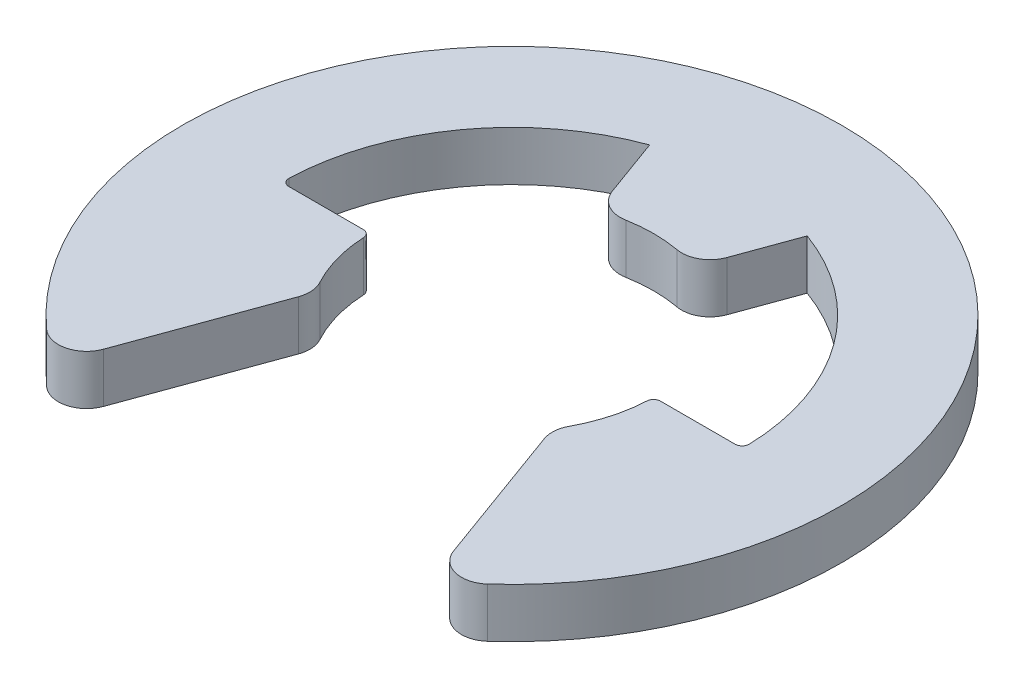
ISO-10303-21;
HEADER;
FILE_DESCRIPTION(('STEP AP214'),'2;1');
FILE_NAME('part.step','',(''),(''),'','','');
FILE_SCHEMA(('AUTOMOTIVE_DESIGN { 1 0 10303 214 1 1 1 1 }'));
ENDSEC;
DATA;
#1=APPLICATION_CONTEXT('core data for automotive mechanical design processes');
#2=APPLICATION_PROTOCOL_DEFINITION('international standard','automotive_design',2000,#1);
#3=PRODUCT_CONTEXT('',#1,'mechanical');
#4=PRODUCT('Part','Part','',(#3));
#5=PRODUCT_RELATED_PRODUCT_CATEGORY('part','',(#4));
#6=PRODUCT_DEFINITION_FORMATION('','',#4);
#7=PRODUCT_DEFINITION_CONTEXT('part definition',#1,'design');
#8=PRODUCT_DEFINITION('design','',#6,#7);
#9=PRODUCT_DEFINITION_SHAPE('','',#8);
#10=(LENGTH_UNIT() NAMED_UNIT(*) SI_UNIT(.MILLI.,.METRE.));
#11=(NAMED_UNIT(*) PLANE_ANGLE_UNIT() SI_UNIT($,.RADIAN.));
#12=(NAMED_UNIT(*) SI_UNIT($,.STERADIAN.) SOLID_ANGLE_UNIT());
#13=UNCERTAINTY_MEASURE_WITH_UNIT(LENGTH_MEASURE(1.E-05),#10,'distance_accuracy_value','');
#14=(GEOMETRIC_REPRESENTATION_CONTEXT(3) GLOBAL_UNCERTAINTY_ASSIGNED_CONTEXT((#13)) GLOBAL_UNIT_ASSIGNED_CONTEXT((#10,
#11,#12)) REPRESENTATION_CONTEXT('',''));
#15=CARTESIAN_POINT('',(0.,0.,0.));
#16=DIRECTION('',(0.,0.,1.));
#17=DIRECTION('',(1.,0.,0.));
#18=AXIS2_PLACEMENT_3D('',#15,#16,#17);
#19=CARTESIAN_POINT('',(0.,0.35,0.));
#20=DIRECTION('',(0.,-1.,0.));
#21=DIRECTION('',(0.,0.,-1.));
#22=AXIS2_PLACEMENT_3D('',#19,#20,#21);
#23=CYLINDRICAL_SURFACE('',#22,3.25);
#24=CARTESIAN_POINT('',(0.,0.35,0.));
#25=DIRECTION('',(0.,-1.,0.));
#26=DIRECTION('',(0.,0.,1.));
#27=AXIS2_PLACEMENT_3D('',#24,#25,#26);
#28=CIRCLE('',#27,3.25);
#29=CARTESIAN_POINT('',(-3.24836189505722,0.35,-0.103174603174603));
#30=VERTEX_POINT('',#29);
#31=CARTESIAN_POINT('',(-1.11156546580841,0.35,-3.05400101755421));
#32=VERTEX_POINT('',#31);
#33=EDGE_CURVE('E187',#30,#32,#28,.T.);
#34=ORIENTED_EDGE('',*,*,#33,.F.);
#35=DIRECTION('',(0.,-1.,0.));
#36=VECTOR('',#35,1.);
#37=CARTESIAN_POINT('',(-3.24836189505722,0.35,-0.103174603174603));
#38=LINE('',#37,#36);
#39=CARTESIAN_POINT('',(-3.24836189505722,-0.35,-0.103174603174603));
#40=VERTEX_POINT('',#39);
#41=EDGE_CURVE('E327',#30,#40,#38,.T.);
#42=ORIENTED_EDGE('',*,*,#41,.T.);
#43=CARTESIAN_POINT('',(0.,-0.35,0.));
#44=DIRECTION('',(0.,-1.,0.));
#45=DIRECTION('',(0.,0.,1.));
#46=AXIS2_PLACEMENT_3D('',#43,#44,#45);
#47=CIRCLE('',#46,3.25);
#48=CARTESIAN_POINT('',(-1.11156546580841,-0.35,-3.05400101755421));
#49=VERTEX_POINT('',#48);
#50=EDGE_CURVE('E211',#40,#49,#47,.T.);
#51=ORIENTED_EDGE('',*,*,#50,.T.);
#52=DIRECTION('',(0.,-1.,0.));
#53=VECTOR('',#52,1.);
#54=CARTESIAN_POINT('',(-1.11156546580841,0.35,-3.05400101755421));
#55=LINE('',#54,#53);
#56=EDGE_CURVE('E204',#32,#49,#55,.T.);
#57=ORIENTED_EDGE('',*,*,#56,.F.);
#58=EDGE_LOOP('',(#34,#42,#51,#57));
#59=FACE_BOUND('',#58,.T.);
#60=ADVANCED_FACE('F39',(#59),#23,.F.);
#61=CARTESIAN_POINT('',(-1.11156546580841,0.35,-3.05400101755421));
#62=DIRECTION('',(0.939692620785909,0.,-0.342020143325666));
#63=DIRECTION('',(-0.342020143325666,0.,-0.93969262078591));
#64=AXIS2_PLACEMENT_3D('',#61,#62,#63);
#65=PLANE('',#64);
#66=DIRECTION('',(0.342020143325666,0.,0.939692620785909));
#67=VECTOR('',#66,1.);
#68=CARTESIAN_POINT('',(-1.11156546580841,-0.35,-3.05400101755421));
#69=LINE('',#68,#67);
#70=CARTESIAN_POINT('',(-0.809367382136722,-0.35,-2.22371860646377));
#71=VERTEX_POINT('',#70);
#72=EDGE_CURVE('E446',#49,#71,#69,.T.);
#73=ORIENTED_EDGE('',*,*,#72,.T.);
#74=DIRECTION('',(0.,-1.,0.));
#75=VECTOR('',#74,1.);
#76=CARTESIAN_POINT('',(-0.809367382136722,0.35,-2.22371860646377));
#77=LINE('',#76,#75);
#78=CARTESIAN_POINT('',(-0.809367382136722,0.35,-2.22371860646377));
#79=VERTEX_POINT('',#78);
#80=EDGE_CURVE('E206',#71,#79,#77,.F.);
#81=ORIENTED_EDGE('',*,*,#80,.T.);
#82=DIRECTION('',(0.342020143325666,0.,0.939692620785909));
#83=VECTOR('',#82,1.);
#84=CARTESIAN_POINT('',(-1.11156546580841,0.35,-3.05400101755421));
#85=LINE('',#84,#83);
#86=EDGE_CURVE('E191',#32,#79,#85,.T.);
#87=ORIENTED_EDGE('',*,*,#86,.F.);
#88=ORIENTED_EDGE('',*,*,#56,.T.);
#89=EDGE_LOOP('',(#73,#81,#87,#88));
#90=FACE_BOUND('',#89,.T.);
#91=ADVANCED_FACE('F203',(#90),#65,.F.);
#92=CARTESIAN_POINT('',(0.,0.35,0.));
#93=DIRECTION('',(0.,-1.,0.));
#94=DIRECTION('',(0.,0.,-1.));
#95=AXIS2_PLACEMENT_3D('',#92,#93,#94);
#96=CYLINDRICAL_SURFACE('',#95,2.);
#97=CARTESIAN_POINT('',(0.,-0.35,0.));
#98=DIRECTION('',(0.,-1.,0.));
#99=DIRECTION('',(0.,0.,1.));
#100=AXIS2_PLACEMENT_3D('',#97,#98,#99);
#101=CIRCLE('',#100,2.);
#102=CARTESIAN_POINT('',(-0.361241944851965,-0.35,-1.96710555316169));
#103=VERTEX_POINT('',#102);
#104=CARTESIAN_POINT('',(0.361241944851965,-0.35,-1.96710555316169));
#105=VERTEX_POINT('',#104);
#106=EDGE_CURVE('E449',#103,#105,#101,.T.);
#107=ORIENTED_EDGE('',*,*,#106,.T.);
#108=DIRECTION('',(0.,-1.,0.));
#109=VECTOR('',#108,1.);
#110=CARTESIAN_POINT('',(0.361241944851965,0.35,-1.96710555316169));
#111=LINE('',#110,#109);
#112=CARTESIAN_POINT('',(0.361241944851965,0.35,-1.96710555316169));
#113=VERTEX_POINT('',#112);
#114=EDGE_CURVE('E289',#105,#113,#111,.F.);
#115=ORIENTED_EDGE('',*,*,#114,.T.);
#116=CARTESIAN_POINT('',(0.,0.35,0.));
#117=DIRECTION('',(0.,-1.,0.));
#118=DIRECTION('',(0.,0.,1.));
#119=AXIS2_PLACEMENT_3D('',#116,#117,#118);
#120=CIRCLE('',#119,2.);
#121=CARTESIAN_POINT('',(-0.361241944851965,0.35,-1.96710555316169));
#122=VERTEX_POINT('',#121);
#123=EDGE_CURVE('E208',#122,#113,#120,.T.);
#124=ORIENTED_EDGE('',*,*,#123,.F.);
#125=DIRECTION('',(0.,-1.,0.));
#126=VECTOR('',#125,1.);
#127=CARTESIAN_POINT('',(-0.361241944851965,0.35,-1.96710555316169));
#128=LINE('',#127,#126);
#129=EDGE_CURVE('E285',#122,#103,#128,.T.);
#130=ORIENTED_EDGE('',*,*,#129,.T.);
#131=EDGE_LOOP('',(#107,#115,#124,#130));
#132=FACE_BOUND('',#131,.T.);
#133=ADVANCED_FACE('F370',(#132),#96,.F.);
#134=CARTESIAN_POINT('',(0.684040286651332,0.35,-1.87938524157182));
#135=DIRECTION('',(-0.93969262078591,0.,-0.342020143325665));
#136=DIRECTION('',(-0.342020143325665,0.,0.93969262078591));
#137=AXIS2_PLACEMENT_3D('',#134,#135,#136);
#138=PLANE('',#137);
#139=DIRECTION('',(0.342020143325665,0.,-0.93969262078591));
#140=VECTOR('',#139,1.);
#141=CARTESIAN_POINT('',(0.684040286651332,0.35,-1.87938524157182));
#142=LINE('',#141,#140);
#143=CARTESIAN_POINT('',(0.809367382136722,0.35,-2.22371860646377));
#144=VERTEX_POINT('',#143);
#145=CARTESIAN_POINT('',(1.11156546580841,0.35,-3.05400101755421));
#146=VERTEX_POINT('',#145);
#147=EDGE_CURVE('E423',#144,#146,#142,.T.);
#148=ORIENTED_EDGE('',*,*,#147,.F.);
#149=DIRECTION('',(0.,-1.,0.));
#150=VECTOR('',#149,1.);
#151=CARTESIAN_POINT('',(0.809367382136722,0.35,-2.22371860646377));
#152=LINE('',#151,#150);
#153=CARTESIAN_POINT('',(0.809367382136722,-0.35,-2.22371860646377));
#154=VERTEX_POINT('',#153);
#155=EDGE_CURVE('E281',#144,#154,#152,.T.);
#156=ORIENTED_EDGE('',*,*,#155,.T.);
#157=DIRECTION('',(0.342020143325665,0.,-0.93969262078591));
#158=VECTOR('',#157,1.);
#159=CARTESIAN_POINT('',(0.684040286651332,-0.35,-1.87938524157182));
#160=LINE('',#159,#158);
#161=CARTESIAN_POINT('',(1.11156546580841,-0.35,-3.05400101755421));
#162=VERTEX_POINT('',#161);
#163=EDGE_CURVE('E453',#154,#162,#160,.T.);
#164=ORIENTED_EDGE('',*,*,#163,.T.);
#165=DIRECTION('',(0.,-1.,0.));
#166=VECTOR('',#165,1.);
#167=CARTESIAN_POINT('',(1.11156546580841,0.35,-3.05400101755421));
#168=LINE('',#167,#166);
#169=EDGE_CURVE('E215',#146,#162,#168,.T.);
#170=ORIENTED_EDGE('',*,*,#169,.F.);
#171=EDGE_LOOP('',(#148,#156,#164,#170));
#172=FACE_BOUND('',#171,.T.);
#173=ADVANCED_FACE('F527',(#172),#138,.F.);
#174=CARTESIAN_POINT('',(0.,0.35,0.));
#175=DIRECTION('',(0.,-1.,0.));
#176=DIRECTION('',(0.,0.,-1.));
#177=AXIS2_PLACEMENT_3D('',#174,#175,#176);
#178=CYLINDRICAL_SURFACE('',#177,3.25);
#179=CARTESIAN_POINT('',(0.,-0.35,0.));
#180=DIRECTION('',(0.,-1.,0.));
#181=DIRECTION('',(0.,0.,1.));
#182=AXIS2_PLACEMENT_3D('',#179,#180,#181);
#183=CIRCLE('',#182,3.25);
#184=CARTESIAN_POINT('',(3.24836189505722,-0.35,-0.103174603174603));
#185=VERTEX_POINT('',#184);
#186=EDGE_CURVE('E456',#162,#185,#183,.T.);
#187=ORIENTED_EDGE('',*,*,#186,.T.);
#188=DIRECTION('',(0.,-1.,0.));
#189=VECTOR('',#188,1.);
#190=CARTESIAN_POINT('',(3.24836189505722,0.35,-0.103174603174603));
#191=LINE('',#190,#189);
#192=CARTESIAN_POINT('',(3.24836189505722,0.35,-0.103174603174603));
#193=VERTEX_POINT('',#192);
#194=EDGE_CURVE('E308',#185,#193,#191,.F.);
#195=ORIENTED_EDGE('',*,*,#194,.T.);
#196=CARTESIAN_POINT('',(0.,0.35,0.));
#197=DIRECTION('',(0.,-1.,0.));
#198=DIRECTION('',(0.,0.,1.));
#199=AXIS2_PLACEMENT_3D('',#196,#197,#198);
#200=CIRCLE('',#199,3.25);
#201=EDGE_CURVE('E410',#146,#193,#200,.T.);
#202=ORIENTED_EDGE('',*,*,#201,.F.);
#203=ORIENTED_EDGE('',*,*,#169,.T.);
#204=EDGE_LOOP('',(#187,#195,#202,#203));
#205=FACE_BOUND('',#204,.T.);
#206=ADVANCED_FACE('F521',(#205),#178,.F.);
#207=CARTESIAN_POINT('',(2.,0.35,0.));
#208=DIRECTION('',(0.,0.,1.));
#209=DIRECTION('',(1.,0.,0.));
#210=AXIS2_PLACEMENT_3D('',#207,#208,#209);
#211=PLANE('',#210);
#212=DIRECTION('',(-1.,0.,0.));
#213=VECTOR('',#212,1.);
#214=CARTESIAN_POINT('',(2.,0.35,0.));
#215=LINE('',#214,#213);
#216=CARTESIAN_POINT('',(3.14841229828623,0.35,0.));
#217=VERTEX_POINT('',#216);
#218=CARTESIAN_POINT('',(2.0976176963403,0.35,0.));
#219=VERTEX_POINT('',#218);
#220=EDGE_CURVE('E407',#217,#219,#215,.T.);
#221=ORIENTED_EDGE('',*,*,#220,.F.);
#222=DIRECTION('',(0.,1.,0.));
#223=VECTOR('',#222,1.);
#224=CARTESIAN_POINT('',(3.14841229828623,-0.35,0.));
#225=LINE('',#224,#223);
#226=CARTESIAN_POINT('',(3.14841229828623,-0.35,0.));
#227=VERTEX_POINT('',#226);
#228=EDGE_CURVE('E304',#217,#227,#225,.F.);
#229=ORIENTED_EDGE('',*,*,#228,.T.);
#230=DIRECTION('',(-1.,0.,0.));
#231=VECTOR('',#230,1.);
#232=CARTESIAN_POINT('',(2.,-0.35,0.));
#233=LINE('',#232,#231);
#234=CARTESIAN_POINT('',(2.0976176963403,-0.35,0.));
#235=VERTEX_POINT('',#234);
#236=EDGE_CURVE('E460',#227,#235,#233,.T.);
#237=ORIENTED_EDGE('',*,*,#236,.T.);
#238=DIRECTION('',(0.,-1.,0.));
#239=VECTOR('',#238,1.);
#240=CARTESIAN_POINT('',(2.0976176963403,0.35,0.));
#241=LINE('',#240,#239);
#242=EDGE_CURVE('E301',#235,#219,#241,.F.);
#243=ORIENTED_EDGE('',*,*,#242,.T.);
#244=EDGE_LOOP('',(#221,#229,#237,#243));
#245=FACE_BOUND('',#244,.T.);
#246=ADVANCED_FACE('F412',(#245),#211,.F.);
#247=CARTESIAN_POINT('',(0.,0.35,0.));
#248=DIRECTION('',(0.,-1.,0.));
#249=DIRECTION('',(0.,0.,-1.));
#250=AXIS2_PLACEMENT_3D('',#247,#248,#249);
#251=CYLINDRICAL_SURFACE('',#250,2.);
#252=CARTESIAN_POINT('',(0.,0.35,0.));
#253=DIRECTION('',(0.,-1.,0.));
#254=DIRECTION('',(0.,0.,1.));
#255=AXIS2_PLACEMENT_3D('',#252,#253,#254);
#256=CIRCLE('',#255,2.);
#257=CARTESIAN_POINT('',(1.99773113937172,0.35,0.0952380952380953));
#258=VERTEX_POINT('',#257);
#259=CARTESIAN_POINT('',(1.75901652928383,0.35,0.951767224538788));
#260=VERTEX_POINT('',#259);
#261=EDGE_CURVE('E417',#258,#260,#256,.T.);
#262=ORIENTED_EDGE('',*,*,#261,.F.);
#263=DIRECTION('',(0.,-1.,0.));
#264=VECTOR('',#263,1.);
#265=CARTESIAN_POINT('',(1.99773113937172,0.35,0.0952380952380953));
#266=LINE('',#265,#264);
#267=CARTESIAN_POINT('',(1.99773113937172,-0.35,0.0952380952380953));
#268=VERTEX_POINT('',#267);
#269=EDGE_CURVE('E311',#258,#268,#266,.T.);
#270=ORIENTED_EDGE('',*,*,#269,.T.);
#271=CARTESIAN_POINT('',(0.,-0.35,0.));
#272=DIRECTION('',(0.,-1.,0.));
#273=DIRECTION('',(0.,0.,1.));
#274=AXIS2_PLACEMENT_3D('',#271,#272,#273);
#275=CIRCLE('',#274,2.);
#276=CARTESIAN_POINT('',(1.75901652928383,-0.35,0.951767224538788));
#277=VERTEX_POINT('',#276);
#278=EDGE_CURVE('E463',#268,#277,#275,.T.);
#279=ORIENTED_EDGE('',*,*,#278,.T.);
#280=DIRECTION('',(0.,-1.,0.));
#281=VECTOR('',#280,1.);
#282=CARTESIAN_POINT('',(1.75901652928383,0.35,0.951767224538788));
#283=LINE('',#282,#281);
#284=EDGE_CURVE('E250',#277,#260,#283,.F.);
#285=ORIENTED_EDGE('',*,*,#284,.T.);
#286=EDGE_LOOP('',(#262,#270,#279,#285));
#287=FACE_BOUND('',#286,.T.);
#288=ADVANCED_FACE('F512',(#287),#251,.F.);
#289=CARTESIAN_POINT('',(1.67,0.35,1.10049988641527));
#290=DIRECTION('',(0.939692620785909,0.,-0.342020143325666));
#291=DIRECTION('',(-0.342020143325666,0.,-0.939692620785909));
#292=AXIS2_PLACEMENT_3D('',#289,#290,#291);
#293=PLANE('',#292);
#294=DIRECTION('',(0.342020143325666,0.,0.939692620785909));
#295=VECTOR('',#294,1.);
#296=CARTESIAN_POINT('',(1.67,0.35,1.10049988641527));
#297=LINE('',#296,#295);
#298=CARTESIAN_POINT('',(1.73494278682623,0.35,1.27892872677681));
#299=VERTEX_POINT('',#298);
#300=CARTESIAN_POINT('',(2.46858164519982,0.35,3.29458492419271));
#301=VERTEX_POINT('',#300);
#302=EDGE_CURVE('E420',#299,#301,#297,.T.);
#303=ORIENTED_EDGE('',*,*,#302,.F.);
#304=DIRECTION('',(0.,-1.,0.));
#305=VECTOR('',#304,1.);
#306=CARTESIAN_POINT('',(1.73494278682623,0.35,1.27892872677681));
#307=LINE('',#306,#305);
#308=CARTESIAN_POINT('',(1.73494278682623,-0.35,1.27892872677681));
#309=VERTEX_POINT('',#308);
#310=EDGE_CURVE('E220',#299,#309,#307,.T.);
#311=ORIENTED_EDGE('',*,*,#310,.T.);
#312=DIRECTION('',(0.342020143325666,0.,0.939692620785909));
#313=VECTOR('',#312,1.);
#314=CARTESIAN_POINT('',(1.67,-0.35,1.10049988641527));
#315=LINE('',#314,#313);
#316=CARTESIAN_POINT('',(2.46858164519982,-0.35,3.29458492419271));
#317=VERTEX_POINT('',#316);
#318=EDGE_CURVE('E466',#309,#317,#315,.T.);
#319=ORIENTED_EDGE('',*,*,#318,.T.);
#320=DIRECTION('',(0.,-1.,0.));
#321=VECTOR('',#320,1.);
#322=CARTESIAN_POINT('',(2.46858164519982,0.35,3.29458492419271));
#323=LINE('',#322,#321);
#324=EDGE_CURVE('E214',#317,#301,#323,.F.);
#325=ORIENTED_EDGE('',*,*,#324,.T.);
#326=EDGE_LOOP('',(#303,#311,#319,#325));
#327=FACE_BOUND('',#326,.T.);
#328=ADVANCED_FACE('F506',(#327),#293,.F.);
#329=CARTESIAN_POINT('',(0.,0.35,0.));
#330=DIRECTION('',(0.,-1.,0.));
#331=DIRECTION('',(0.,0.,-1.));
#332=AXIS2_PLACEMENT_3D('',#329,#330,#331);
#333=CYLINDRICAL_SURFACE('',#332,4.65);
#334=CARTESIAN_POINT('',(0.,0.35,0.));
#335=DIRECTION('',(0.,1.,0.));
#336=DIRECTION('',(0.,0.,1.));
#337=AXIS2_PLACEMENT_3D('',#334,#335,#336);
#338=CIRCLE('',#337,4.65);
#339=CARTESIAN_POINT('',(3.11217245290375,0.35,3.45497939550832));
#340=VERTEX_POINT('',#339);
#341=CARTESIAN_POINT('',(-3.11217245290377,0.35,3.4549793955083));
#342=VERTEX_POINT('',#341);
#343=EDGE_CURVE('E430',#340,#342,#338,.T.);
#344=ORIENTED_EDGE('',*,*,#343,.F.);
#345=DIRECTION('',(0.,-1.,0.));
#346=VECTOR('',#345,1.);
#347=CARTESIAN_POINT('',(3.11217245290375,0.35,3.45497939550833));
#348=LINE('',#347,#346);
#349=CARTESIAN_POINT('',(3.11217245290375,-0.35,3.45497939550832));
#350=VERTEX_POINT('',#349);
#351=EDGE_CURVE('E297',#340,#350,#348,.T.);
#352=ORIENTED_EDGE('',*,*,#351,.T.);
#353=CARTESIAN_POINT('',(0.,-0.35,0.));
#354=DIRECTION('',(0.,1.,0.));
#355=DIRECTION('',(0.,0.,1.));
#356=AXIS2_PLACEMENT_3D('',#353,#354,#355);
#357=CIRCLE('',#356,4.65);
#358=CARTESIAN_POINT('',(-3.11217245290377,-0.35,3.4549793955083));
#359=VERTEX_POINT('',#358);
#360=EDGE_CURVE('E470',#350,#359,#357,.T.);
#361=ORIENTED_EDGE('',*,*,#360,.T.);
#362=DIRECTION('',(0.,-1.,0.));
#363=VECTOR('',#362,1.);
#364=CARTESIAN_POINT('',(-3.11217245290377,0.35,3.4549793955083));
#365=LINE('',#364,#363);
#366=EDGE_CURVE('E294',#359,#342,#365,.F.);
#367=ORIENTED_EDGE('',*,*,#366,.T.);
#368=EDGE_LOOP('',(#344,#352,#361,#367));
#369=FACE_BOUND('',#368,.T.);
#370=ADVANCED_FACE('F499',(#369),#333,.T.);
#371=CARTESIAN_POINT('',(-2.65812378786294,0.35,3.81534768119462));
#372=DIRECTION('',(-0.939692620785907,0.,-0.342020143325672));
#373=DIRECTION('',(-0.342020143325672,0.,0.939692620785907));
#374=AXIS2_PLACEMENT_3D('',#371,#372,#373);
#375=PLANE('',#374);
#376=DIRECTION('',(0.342020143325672,0.,-0.939692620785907));
#377=VECTOR('',#376,1.);
#378=CARTESIAN_POINT('',(-2.65812378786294,-0.35,3.81534768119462));
#379=LINE('',#378,#377);
#380=CARTESIAN_POINT('',(-2.46858164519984,-0.35,3.2945849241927));
#381=VERTEX_POINT('',#380);
#382=CARTESIAN_POINT('',(-1.73494278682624,-0.35,1.2789287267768));
#383=VERTEX_POINT('',#382);
#384=EDGE_CURVE('E474',#381,#383,#379,.T.);
#385=ORIENTED_EDGE('',*,*,#384,.T.);
#386=DIRECTION('',(0.,-1.,0.));
#387=VECTOR('',#386,1.);
#388=CARTESIAN_POINT('',(-1.73494278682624,0.35,1.2789287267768));
#389=LINE('',#388,#387);
#390=CARTESIAN_POINT('',(-1.73494278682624,0.35,1.2789287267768));
#391=VERTEX_POINT('',#390);
#392=EDGE_CURVE('E278',#383,#391,#389,.F.);
#393=ORIENTED_EDGE('',*,*,#392,.T.);
#394=DIRECTION('',(0.342020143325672,0.,-0.939692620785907));
#395=VECTOR('',#394,1.);
#396=CARTESIAN_POINT('',(-2.65812378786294,0.35,3.81534768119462));
#397=LINE('',#396,#395);
#398=CARTESIAN_POINT('',(-2.46858164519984,0.35,3.2945849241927));
#399=VERTEX_POINT('',#398);
#400=EDGE_CURVE('E434',#399,#391,#397,.T.);
#401=ORIENTED_EDGE('',*,*,#400,.F.);
#402=DIRECTION('',(0.,-1.,0.));
#403=VECTOR('',#402,1.);
#404=CARTESIAN_POINT('',(-2.46858164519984,0.35,3.2945849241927));
#405=LINE('',#404,#403);
#406=EDGE_CURVE('E275',#399,#381,#405,.T.);
#407=ORIENTED_EDGE('',*,*,#406,.T.);
#408=EDGE_LOOP('',(#385,#393,#401,#407));
#409=FACE_BOUND('',#408,.T.);
#410=ADVANCED_FACE('F491',(#409),#375,.F.);
#411=CARTESIAN_POINT('',(0.,0.35,0.));
#412=DIRECTION('',(0.,-1.,0.));
#413=DIRECTION('',(0.,0.,-1.));
#414=AXIS2_PLACEMENT_3D('',#411,#412,#413);
#415=CYLINDRICAL_SURFACE('',#414,2.);
#416=CARTESIAN_POINT('',(0.,-0.35,0.));
#417=DIRECTION('',(0.,-1.,0.));
#418=DIRECTION('',(0.,0.,1.));
#419=AXIS2_PLACEMENT_3D('',#416,#417,#418);
#420=CIRCLE('',#419,2.);
#421=CARTESIAN_POINT('',(-1.75901652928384,-0.35,0.951767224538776));
#422=VERTEX_POINT('',#421);
#423=CARTESIAN_POINT('',(-1.99773113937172,-0.35,0.0952380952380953));
#424=VERTEX_POINT('',#423);
#425=EDGE_CURVE('E353',#422,#424,#420,.T.);
#426=ORIENTED_EDGE('',*,*,#425,.T.);
#427=DIRECTION('',(0.,-1.,0.));
#428=VECTOR('',#427,1.);
#429=CARTESIAN_POINT('',(-1.99773113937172,0.35,0.0952380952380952));
#430=LINE('',#429,#428);
#431=CARTESIAN_POINT('',(-1.99773113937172,0.35,0.0952380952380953));
#432=VERTEX_POINT('',#431);
#433=EDGE_CURVE('E336',#424,#432,#430,.F.);
#434=ORIENTED_EDGE('',*,*,#433,.T.);
#435=CARTESIAN_POINT('',(0.,0.35,0.));
#436=DIRECTION('',(0.,-1.,0.));
#437=DIRECTION('',(0.,0.,1.));
#438=AXIS2_PLACEMENT_3D('',#435,#436,#437);
#439=CIRCLE('',#438,2.);
#440=CARTESIAN_POINT('',(-1.75901652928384,0.35,0.951767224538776));
#441=VERTEX_POINT('',#440);
#442=EDGE_CURVE('E438',#441,#432,#439,.T.);
#443=ORIENTED_EDGE('',*,*,#442,.F.);
#444=DIRECTION('',(0.,-1.,0.));
#445=VECTOR('',#444,1.);
#446=CARTESIAN_POINT('',(-1.75901652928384,0.35,0.951767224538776));
#447=LINE('',#446,#445);
#448=EDGE_CURVE('E271',#441,#422,#447,.T.);
#449=ORIENTED_EDGE('',*,*,#448,.T.);
#450=EDGE_LOOP('',(#426,#434,#443,#449));
#451=FACE_BOUND('',#450,.T.);
#452=ADVANCED_FACE('F483',(#451),#415,.F.);
#453=CARTESIAN_POINT('',(-2.,0.35,0.));
#454=DIRECTION('',(0.,0.,1.));
#455=DIRECTION('',(1.,0.,0.));
#456=AXIS2_PLACEMENT_3D('',#453,#454,#455);
#457=PLANE('',#456);
#458=DIRECTION('',(-1.,0.,0.));
#459=VECTOR('',#458,1.);
#460=CARTESIAN_POINT('',(-2.,-0.35,0.));
#461=LINE('',#460,#459);
#462=CARTESIAN_POINT('',(-2.0976176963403,-0.35,0.));
#463=VERTEX_POINT('',#462);
#464=CARTESIAN_POINT('',(-3.14841229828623,-0.35,0.));
#465=VERTEX_POINT('',#464);
#466=EDGE_CURVE('E198',#463,#465,#461,.T.);
#467=ORIENTED_EDGE('',*,*,#466,.T.);
#468=DIRECTION('',(0.,1.,0.));
#469=VECTOR('',#468,1.);
#470=CARTESIAN_POINT('',(-3.14841229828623,0.35,0.));
#471=LINE('',#470,#469);
#472=CARTESIAN_POINT('',(-3.14841229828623,0.35,0.));
#473=VERTEX_POINT('',#472);
#474=EDGE_CURVE('E61',#465,#473,#471,.T.);
#475=ORIENTED_EDGE('',*,*,#474,.T.);
#476=DIRECTION('',(-1.,0.,0.));
#477=VECTOR('',#476,1.);
#478=CARTESIAN_POINT('',(-2.,0.35,0.));
#479=LINE('',#478,#477);
#480=CARTESIAN_POINT('',(-2.0976176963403,0.35,0.));
#481=VERTEX_POINT('',#480);
#482=EDGE_CURVE('E224',#481,#473,#479,.T.);
#483=ORIENTED_EDGE('',*,*,#482,.F.);
#484=DIRECTION('',(0.,-1.,0.));
#485=VECTOR('',#484,1.);
#486=CARTESIAN_POINT('',(-2.0976176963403,0.35,0.));
#487=LINE('',#486,#485);
#488=EDGE_CURVE('E330',#481,#463,#487,.T.);
#489=ORIENTED_EDGE('',*,*,#488,.T.);
#490=EDGE_LOOP('',(#467,#475,#483,#489));
#491=FACE_BOUND('',#490,.T.);
#492=ADVANCED_FACE('F350',(#491),#457,.F.);
#493=CARTESIAN_POINT('',(0.,0.35,0.));
#494=DIRECTION('',(0.,1.,0.));
#495=DIRECTION('',(0.,0.,1.));
#496=AXIS2_PLACEMENT_3D('',#493,#494,#495);
#497=PLANE('',#496);
#498=ORIENTED_EDGE('',*,*,#220,.T.);
#499=CARTESIAN_POINT('',(2.0976176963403,0.35,0.1));
#500=DIRECTION('',(0.,1.,0.));
#501=DIRECTION('',(0.,0.,1.));
#502=AXIS2_PLACEMENT_3D('',#499,#500,#501);
#503=CIRCLE('',#502,0.1);
#504=EDGE_CURVE('E324',#219,#258,#503,.T.);
#505=ORIENTED_EDGE('',*,*,#504,.T.);
#506=ORIENTED_EDGE('',*,*,#261,.T.);
#507=CARTESIAN_POINT('',(2.1108198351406,0.35,1.14212066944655));
#508=DIRECTION('',(0.,1.,0.));
#509=DIRECTION('',(0.,0.,1.));
#510=AXIS2_PLACEMENT_3D('',#507,#508,#509);
#511=CIRCLE('',#510,0.4);
#512=EDGE_CURVE('E268',#260,#299,#511,.T.);
#513=ORIENTED_EDGE('',*,*,#512,.T.);
#514=ORIENTED_EDGE('',*,*,#302,.T.);
#515=CARTESIAN_POINT('',(2.84445869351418,0.35,3.15777686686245));
#516=DIRECTION('',(0.,1.,0.));
#517=DIRECTION('',(0.,0.,1.));
#518=AXIS2_PLACEMENT_3D('',#515,#516,#517);
#519=CIRCLE('',#518,0.4);
#520=EDGE_CURVE('E256',#301,#340,#519,.T.);
#521=ORIENTED_EDGE('',*,*,#520,.T.);
#522=ORIENTED_EDGE('',*,*,#343,.T.);
#523=CARTESIAN_POINT('',(-2.8444586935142,0.35,3.15777686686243));
#524=DIRECTION('',(0.,1.,0.));
#525=DIRECTION('',(0.,0.,1.));
#526=AXIS2_PLACEMENT_3D('',#523,#524,#525);
#527=CIRCLE('',#526,0.4);
#528=EDGE_CURVE('E253',#342,#399,#527,.T.);
#529=ORIENTED_EDGE('',*,*,#528,.T.);
#530=ORIENTED_EDGE('',*,*,#400,.T.);
#531=CARTESIAN_POINT('',(-2.1108198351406,0.35,1.14212066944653));
#532=DIRECTION('',(0.,1.,0.));
#533=DIRECTION('',(0.,0.,1.));
#534=AXIS2_PLACEMENT_3D('',#531,#532,#533);
#535=CIRCLE('',#534,0.4);
#536=EDGE_CURVE('E265',#391,#441,#535,.T.);
#537=ORIENTED_EDGE('',*,*,#536,.T.);
#538=ORIENTED_EDGE('',*,*,#442,.T.);
#539=CARTESIAN_POINT('',(-2.0976176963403,0.35,0.1));
#540=DIRECTION('',(0.,1.,0.));
#541=DIRECTION('',(0.,0.,1.));
#542=AXIS2_PLACEMENT_3D('',#539,#540,#541);
#543=CIRCLE('',#542,0.1);
#544=EDGE_CURVE('E321',#432,#481,#543,.T.);
#545=ORIENTED_EDGE('',*,*,#544,.T.);
#546=ORIENTED_EDGE('',*,*,#482,.T.);
#547=CARTESIAN_POINT('',(-3.14841229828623,0.35,-0.1));
#548=DIRECTION('',(0.,1.,0.));
#549=DIRECTION('',(0.,0.,1.));
#550=AXIS2_PLACEMENT_3D('',#547,#548,#549);
#551=CIRCLE('',#550,0.1);
#552=EDGE_CURVE('E11',#473,#30,#551,.F.);
#553=ORIENTED_EDGE('',*,*,#552,.T.);
#554=ORIENTED_EDGE('',*,*,#33,.T.);
#555=ORIENTED_EDGE('',*,*,#86,.T.);
#556=CARTESIAN_POINT('',(-0.433490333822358,0.35,-2.36052666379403));
#557=DIRECTION('',(0.,1.,0.));
#558=DIRECTION('',(0.,0.,1.));
#559=AXIS2_PLACEMENT_3D('',#556,#557,#558);
#560=CIRCLE('',#559,0.4);
#561=EDGE_CURVE('E259',#79,#122,#560,.T.);
#562=ORIENTED_EDGE('',*,*,#561,.T.);
#563=ORIENTED_EDGE('',*,*,#123,.T.);
#564=CARTESIAN_POINT('',(0.433490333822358,0.35,-2.36052666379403));
#565=DIRECTION('',(0.,1.,0.));
#566=DIRECTION('',(0.,0.,1.));
#567=AXIS2_PLACEMENT_3D('',#564,#565,#566);
#568=CIRCLE('',#567,0.4);
#569=EDGE_CURVE('E262',#113,#144,#568,.T.);
#570=ORIENTED_EDGE('',*,*,#569,.T.);
#571=ORIENTED_EDGE('',*,*,#147,.T.);
#572=ORIENTED_EDGE('',*,*,#201,.T.);
#573=CARTESIAN_POINT('',(3.14841229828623,0.35,-0.1));
#574=DIRECTION('',(0.,1.,0.));
#575=DIRECTION('',(0.,0.,1.));
#576=AXIS2_PLACEMENT_3D('',#573,#574,#575);
#577=CIRCLE('',#576,0.1);
#578=EDGE_CURVE('E342',#193,#217,#577,.F.);
#579=ORIENTED_EDGE('',*,*,#578,.T.);
#580=EDGE_LOOP('',(#498,#505,#506,#513,#514,#521,#522,#529,#530,#537,#538,#545,#546,#553,#554,
#555,#562,#563,#570,#571,#572,#579));
#581=FACE_BOUND('',#580,.T.);
#582=ADVANCED_FACE('F190',(#581),#497,.T.);
#583=CARTESIAN_POINT('',(0.,-0.35,0.));
#584=DIRECTION('',(0.,1.,0.));
#585=DIRECTION('',(0.,0.,1.));
#586=AXIS2_PLACEMENT_3D('',#583,#584,#585);
#587=PLANE('',#586);
#588=ORIENTED_EDGE('',*,*,#278,.F.);
#589=CARTESIAN_POINT('',(2.0976176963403,-0.35,0.1));
#590=DIRECTION('',(0.,1.,0.));
#591=DIRECTION('',(0.,0.,1.));
#592=AXIS2_PLACEMENT_3D('',#589,#590,#591);
#593=CIRCLE('',#592,0.1);
#594=EDGE_CURVE('E318',#268,#235,#593,.F.);
#595=ORIENTED_EDGE('',*,*,#594,.T.);
#596=ORIENTED_EDGE('',*,*,#236,.F.);
#597=CARTESIAN_POINT('',(3.14841229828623,-0.35,-0.1));
#598=DIRECTION('',(0.,1.,0.));
#599=DIRECTION('',(0.,0.,1.));
#600=AXIS2_PLACEMENT_3D('',#597,#598,#599);
#601=CIRCLE('',#600,0.1);
#602=EDGE_CURVE('E339',#227,#185,#601,.T.);
#603=ORIENTED_EDGE('',*,*,#602,.T.);
#604=ORIENTED_EDGE('',*,*,#186,.F.);
#605=ORIENTED_EDGE('',*,*,#163,.F.);
#606=CARTESIAN_POINT('',(0.433490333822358,-0.35,-2.36052666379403));
#607=DIRECTION('',(0.,1.,0.));
#608=DIRECTION('',(0.,0.,1.));
#609=AXIS2_PLACEMENT_3D('',#606,#607,#608);
#610=CIRCLE('',#609,0.4);
#611=EDGE_CURVE('E240',#154,#105,#610,.F.);
#612=ORIENTED_EDGE('',*,*,#611,.T.);
#613=ORIENTED_EDGE('',*,*,#106,.F.);
#614=CARTESIAN_POINT('',(-0.433490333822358,-0.35,-2.36052666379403));
#615=DIRECTION('',(0.,1.,0.));
#616=DIRECTION('',(0.,0.,1.));
#617=AXIS2_PLACEMENT_3D('',#614,#615,#616);
#618=CIRCLE('',#617,0.4);
#619=EDGE_CURVE('E237',#103,#71,#618,.F.);
#620=ORIENTED_EDGE('',*,*,#619,.T.);
#621=ORIENTED_EDGE('',*,*,#72,.F.);
#622=ORIENTED_EDGE('',*,*,#50,.F.);
#623=CARTESIAN_POINT('',(-3.14841229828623,-0.35,-0.1));
#624=DIRECTION('',(0.,1.,0.));
#625=DIRECTION('',(0.,0.,1.));
#626=AXIS2_PLACEMENT_3D('',#623,#624,#625);
#627=CIRCLE('',#626,0.1);
#628=EDGE_CURVE('E48',#40,#465,#627,.T.);
#629=ORIENTED_EDGE('',*,*,#628,.T.);
#630=ORIENTED_EDGE('',*,*,#466,.F.);
#631=CARTESIAN_POINT('',(-2.0976176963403,-0.35,0.1));
#632=DIRECTION('',(0.,1.,0.));
#633=DIRECTION('',(0.,0.,1.));
#634=AXIS2_PLACEMENT_3D('',#631,#632,#633);
#635=CIRCLE('',#634,0.1);
#636=EDGE_CURVE('E315',#463,#424,#635,.F.);
#637=ORIENTED_EDGE('',*,*,#636,.T.);
#638=ORIENTED_EDGE('',*,*,#425,.F.);
#639=CARTESIAN_POINT('',(-2.1108198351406,-0.35,1.14212066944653));
#640=DIRECTION('',(0.,1.,0.));
#641=DIRECTION('',(0.,0.,1.));
#642=AXIS2_PLACEMENT_3D('',#639,#640,#641);
#643=CIRCLE('',#642,0.4);
#644=EDGE_CURVE('E243',#422,#383,#643,.F.);
#645=ORIENTED_EDGE('',*,*,#644,.T.);
#646=ORIENTED_EDGE('',*,*,#384,.F.);
#647=CARTESIAN_POINT('',(-2.8444586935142,-0.35,3.15777686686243));
#648=DIRECTION('',(0.,1.,0.));
#649=DIRECTION('',(0.,0.,1.));
#650=AXIS2_PLACEMENT_3D('',#647,#648,#649);
#651=CIRCLE('',#650,0.4);
#652=EDGE_CURVE('E231',#381,#359,#651,.F.);
#653=ORIENTED_EDGE('',*,*,#652,.T.);
#654=ORIENTED_EDGE('',*,*,#360,.F.);
#655=CARTESIAN_POINT('',(2.84445869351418,-0.35,3.15777686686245));
#656=DIRECTION('',(0.,1.,0.));
#657=DIRECTION('',(0.,0.,1.));
#658=AXIS2_PLACEMENT_3D('',#655,#656,#657);
#659=CIRCLE('',#658,0.4);
#660=EDGE_CURVE('E234',#350,#317,#659,.F.);
#661=ORIENTED_EDGE('',*,*,#660,.T.);
#662=ORIENTED_EDGE('',*,*,#318,.F.);
#663=CARTESIAN_POINT('',(2.1108198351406,-0.35,1.14212066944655));
#664=DIRECTION('',(0.,1.,0.));
#665=DIRECTION('',(0.,0.,1.));
#666=AXIS2_PLACEMENT_3D('',#663,#664,#665);
#667=CIRCLE('',#666,0.4);
#668=EDGE_CURVE('E246',#309,#277,#667,.F.);
#669=ORIENTED_EDGE('',*,*,#668,.T.);
#670=EDGE_LOOP('',(#588,#595,#596,#603,#604,#605,#612,#613,#620,#621,#622,#629,#630,#637,#638,
#645,#646,#653,#654,#661,#662,#669));
#671=FACE_BOUND('',#670,.T.);
#672=ADVANCED_FACE('F348',(#671),#587,.F.);
#673=CARTESIAN_POINT('',(2.1108198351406,0.35,1.14212066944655));
#674=DIRECTION('',(0.,-1.,0.));
#675=DIRECTION('',(0.,0.,-1.));
#676=AXIS2_PLACEMENT_3D('',#673,#674,#675);
#677=CYLINDRICAL_SURFACE('',#676,0.4);
#678=ORIENTED_EDGE('',*,*,#512,.F.);
#679=ORIENTED_EDGE('',*,*,#284,.F.);
#680=ORIENTED_EDGE('',*,*,#668,.F.);
#681=ORIENTED_EDGE('',*,*,#310,.F.);
#682=EDGE_LOOP('',(#678,#679,#680,#681));
#683=FACE_BOUND('',#682,.T.);
#684=ADVANCED_FACE('F374',(#683),#677,.T.);
#685=CARTESIAN_POINT('',(-2.1108198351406,0.35,1.14212066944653));
#686=DIRECTION('',(0.,-1.,0.));
#687=DIRECTION('',(0.,0.,-1.));
#688=AXIS2_PLACEMENT_3D('',#685,#686,#687);
#689=CYLINDRICAL_SURFACE('',#688,0.4);
#690=ORIENTED_EDGE('',*,*,#536,.F.);
#691=ORIENTED_EDGE('',*,*,#392,.F.);
#692=ORIENTED_EDGE('',*,*,#644,.F.);
#693=ORIENTED_EDGE('',*,*,#448,.F.);
#694=EDGE_LOOP('',(#690,#691,#692,#693));
#695=FACE_BOUND('',#694,.T.);
#696=ADVANCED_FACE('F377',(#695),#689,.T.);
#697=CARTESIAN_POINT('',(0.433490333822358,0.35,-2.36052666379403));
#698=DIRECTION('',(0.,-1.,0.));
#699=DIRECTION('',(0.,0.,-1.));
#700=AXIS2_PLACEMENT_3D('',#697,#698,#699);
#701=CYLINDRICAL_SURFACE('',#700,0.4);
#702=ORIENTED_EDGE('',*,*,#569,.F.);
#703=ORIENTED_EDGE('',*,*,#114,.F.);
#704=ORIENTED_EDGE('',*,*,#611,.F.);
#705=ORIENTED_EDGE('',*,*,#155,.F.);
#706=EDGE_LOOP('',(#702,#703,#704,#705));
#707=FACE_BOUND('',#706,.T.);
#708=ADVANCED_FACE('F381',(#707),#701,.T.);
#709=CARTESIAN_POINT('',(-0.433490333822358,0.35,-2.36052666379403));
#710=DIRECTION('',(0.,-1.,0.));
#711=DIRECTION('',(0.,0.,-1.));
#712=AXIS2_PLACEMENT_3D('',#709,#710,#711);
#713=CYLINDRICAL_SURFACE('',#712,0.4);
#714=ORIENTED_EDGE('',*,*,#561,.F.);
#715=ORIENTED_EDGE('',*,*,#80,.F.);
#716=ORIENTED_EDGE('',*,*,#619,.F.);
#717=ORIENTED_EDGE('',*,*,#129,.F.);
#718=EDGE_LOOP('',(#714,#715,#716,#717));
#719=FACE_BOUND('',#718,.T.);
#720=ADVANCED_FACE('F385',(#719),#713,.T.);
#721=CARTESIAN_POINT('',(2.84445869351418,0.35,3.15777686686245));
#722=DIRECTION('',(0.,-1.,0.));
#723=DIRECTION('',(0.,0.,-1.));
#724=AXIS2_PLACEMENT_3D('',#721,#722,#723);
#725=CYLINDRICAL_SURFACE('',#724,0.4);
#726=ORIENTED_EDGE('',*,*,#520,.F.);
#727=ORIENTED_EDGE('',*,*,#324,.F.);
#728=ORIENTED_EDGE('',*,*,#660,.F.);
#729=ORIENTED_EDGE('',*,*,#351,.F.);
#730=EDGE_LOOP('',(#726,#727,#728,#729));
#731=FACE_BOUND('',#730,.T.);
#732=ADVANCED_FACE('F389',(#731),#725,.T.);
#733=CARTESIAN_POINT('',(-2.8444586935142,0.35,3.15777686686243));
#734=DIRECTION('',(0.,-1.,0.));
#735=DIRECTION('',(0.,0.,-1.));
#736=AXIS2_PLACEMENT_3D('',#733,#734,#735);
#737=CYLINDRICAL_SURFACE('',#736,0.4);
#738=ORIENTED_EDGE('',*,*,#528,.F.);
#739=ORIENTED_EDGE('',*,*,#366,.F.);
#740=ORIENTED_EDGE('',*,*,#652,.F.);
#741=ORIENTED_EDGE('',*,*,#406,.F.);
#742=EDGE_LOOP('',(#738,#739,#740,#741));
#743=FACE_BOUND('',#742,.T.);
#744=ADVANCED_FACE('F393',(#743),#737,.T.);
#745=CARTESIAN_POINT('',(3.14841229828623,0.35,-0.1));
#746=DIRECTION('',(0.,-1.,0.));
#747=DIRECTION('',(0.,0.,-1.));
#748=AXIS2_PLACEMENT_3D('',#745,#746,#747);
#749=CYLINDRICAL_SURFACE('',#748,0.1);
#750=ORIENTED_EDGE('',*,*,#578,.F.);
#751=ORIENTED_EDGE('',*,*,#194,.F.);
#752=ORIENTED_EDGE('',*,*,#602,.F.);
#753=ORIENTED_EDGE('',*,*,#228,.F.);
#754=EDGE_LOOP('',(#750,#751,#752,#753));
#755=FACE_BOUND('',#754,.T.);
#756=ADVANCED_FACE('F362',(#755),#749,.F.);
#757=CARTESIAN_POINT('',(2.0976176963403,0.35,0.1));
#758=DIRECTION('',(0.,-1.,0.));
#759=DIRECTION('',(0.,0.,-1.));
#760=AXIS2_PLACEMENT_3D('',#757,#758,#759);
#761=CYLINDRICAL_SURFACE('',#760,0.1);
#762=ORIENTED_EDGE('',*,*,#504,.F.);
#763=ORIENTED_EDGE('',*,*,#242,.F.);
#764=ORIENTED_EDGE('',*,*,#594,.F.);
#765=ORIENTED_EDGE('',*,*,#269,.F.);
#766=EDGE_LOOP('',(#762,#763,#764,#765));
#767=FACE_BOUND('',#766,.T.);
#768=ADVANCED_FACE('F356',(#767),#761,.T.);
#769=CARTESIAN_POINT('',(-3.14841229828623,0.35,-0.1));
#770=DIRECTION('',(0.,-1.,0.));
#771=DIRECTION('',(0.,0.,-1.));
#772=AXIS2_PLACEMENT_3D('',#769,#770,#771);
#773=CYLINDRICAL_SURFACE('',#772,0.1);
#774=ORIENTED_EDGE('',*,*,#552,.F.);
#775=ORIENTED_EDGE('',*,*,#474,.F.);
#776=ORIENTED_EDGE('',*,*,#628,.F.);
#777=ORIENTED_EDGE('',*,*,#41,.F.);
#778=EDGE_LOOP('',(#774,#775,#776,#777));
#779=FACE_BOUND('',#778,.T.);
#780=ADVANCED_FACE('F354',(#779),#773,.F.);
#781=CARTESIAN_POINT('',(-2.0976176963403,0.35,0.1));
#782=DIRECTION('',(0.,-1.,0.));
#783=DIRECTION('',(0.,0.,-1.));
#784=AXIS2_PLACEMENT_3D('',#781,#782,#783);
#785=CYLINDRICAL_SURFACE('',#784,0.1);
#786=ORIENTED_EDGE('',*,*,#544,.F.);
#787=ORIENTED_EDGE('',*,*,#433,.F.);
#788=ORIENTED_EDGE('',*,*,#636,.F.);
#789=ORIENTED_EDGE('',*,*,#488,.F.);
#790=EDGE_LOOP('',(#786,#787,#788,#789));
#791=FACE_BOUND('',#790,.T.);
#792=ADVANCED_FACE('F41',(#791),#785,.T.);
#793=CLOSED_SHELL('',(#60,#91,#133,#173,#206,#246,#288,#328,#370,#410,#452,#492,#582,#672,#684,
#696,#708,#720,#732,#744,#756,#768,#780,#792));
#794=MANIFOLD_SOLID_BREP('B2',#793);
#795=ADVANCED_BREP_SHAPE_REPRESENTATION('',(#18,#794),#14);
#796=SHAPE_DEFINITION_REPRESENTATION(#9,#795);
ENDSEC;
END-ISO-10303-21;
